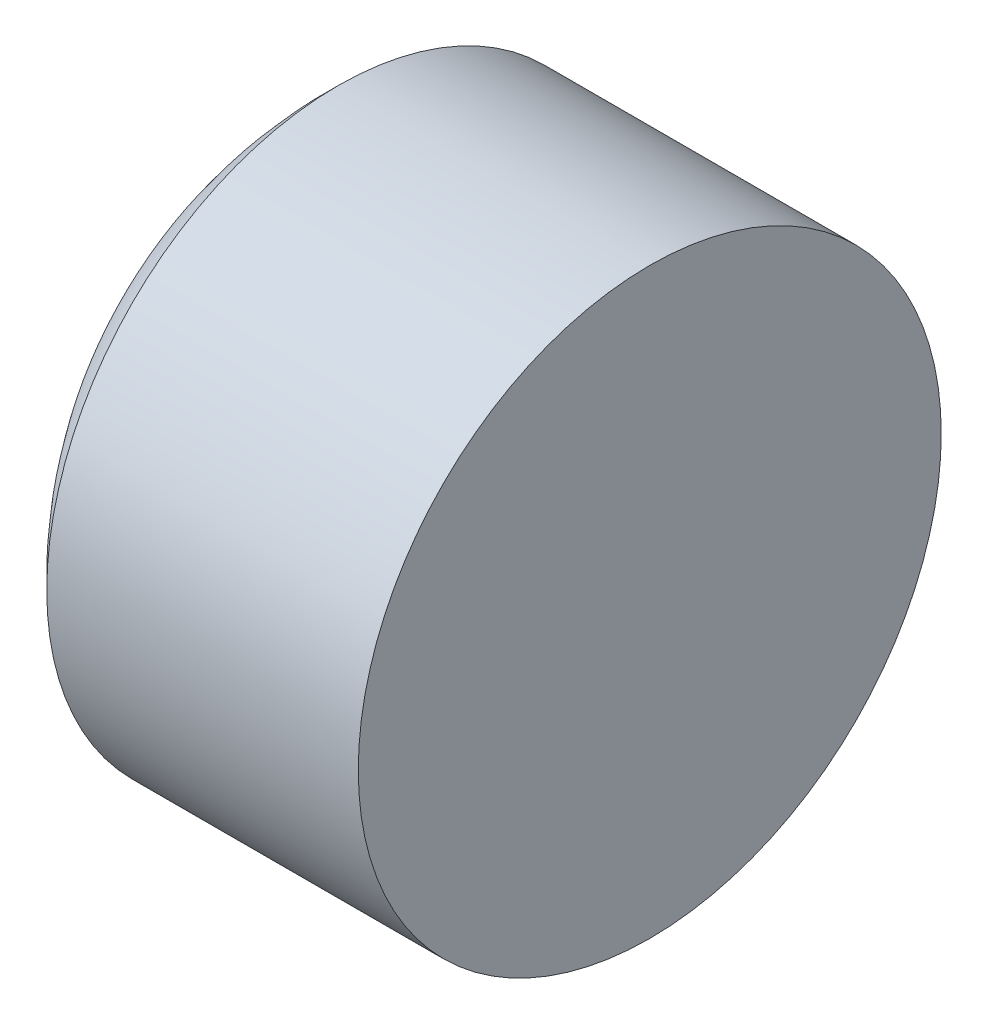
ISO-10303-21;
HEADER;
FILE_DESCRIPTION(('STEP AP214'),'2;1');
FILE_NAME('part.step','',(''),(''),'','','');
FILE_SCHEMA(('AUTOMOTIVE_DESIGN { 1 0 10303 214 1 1 1 1 }'));
ENDSEC;
DATA;
#1=APPLICATION_CONTEXT('core data for automotive mechanical design processes');
#2=APPLICATION_PROTOCOL_DEFINITION('international standard','automotive_design',2000,#1);
#3=PRODUCT_CONTEXT('',#1,'mechanical');
#4=PRODUCT('Part','Part','',(#3));
#5=PRODUCT_RELATED_PRODUCT_CATEGORY('part','',(#4));
#6=PRODUCT_DEFINITION_FORMATION('','',#4);
#7=PRODUCT_DEFINITION_CONTEXT('part definition',#1,'design');
#8=PRODUCT_DEFINITION('design','',#6,#7);
#9=PRODUCT_DEFINITION_SHAPE('','',#8);
#10=(LENGTH_UNIT() NAMED_UNIT(*) SI_UNIT(.MILLI.,.METRE.));
#11=(NAMED_UNIT(*) PLANE_ANGLE_UNIT() SI_UNIT($,.RADIAN.));
#12=(NAMED_UNIT(*) SI_UNIT($,.STERADIAN.) SOLID_ANGLE_UNIT());
#13=UNCERTAINTY_MEASURE_WITH_UNIT(LENGTH_MEASURE(1.E-05),#10,'distance_accuracy_value','');
#14=(GEOMETRIC_REPRESENTATION_CONTEXT(3) GLOBAL_UNCERTAINTY_ASSIGNED_CONTEXT((#13)) GLOBAL_UNIT_ASSIGNED_CONTEXT((#10,
#11,#12)) REPRESENTATION_CONTEXT('',''));
#15=CARTESIAN_POINT('',(0.,0.,0.));
#16=DIRECTION('',(0.,0.,1.));
#17=DIRECTION('',(1.,0.,0.));
#18=AXIS2_PLACEMENT_3D('',#15,#16,#17);
#19=CARTESIAN_POINT('',(0.,0.,0.));
#20=DIRECTION('',(-1.,0.,0.));
#21=DIRECTION('',(0.,1.,0.));
#22=AXIS2_PLACEMENT_3D('',#19,#20,#21);
#23=SPHERICAL_SURFACE('',#22,139.7);
#24=CARTESIAN_POINT('',(-95.8828973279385,0.,0.));
#25=DIRECTION('',(-1.,0.,0.));
#26=DIRECTION('',(0.,0.,1.));
#27=AXIS2_PLACEMENT_3D('',#24,#25,#26);
#28=CIRCLE('',#27,101.6);
#29=CARTESIAN_POINT('',(-95.8828973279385,0.,101.6));
#30=VERTEX_POINT('',#29);
#31=EDGE_CURVE('E42',#30,#30,#28,.T.);
#32=ORIENTED_EDGE('',*,*,#31,.T.);
#33=EDGE_LOOP('',(#32));
#34=FACE_BOUND('',#33,.T.);
#35=ADVANCED_FACE('F35',(#34),#23,.T.);
#36=CARTESIAN_POINT('',(12.7,0.,0.));
#37=DIRECTION('',(-1.,0.,0.));
#38=DIRECTION('',(0.,0.,1.));
#39=AXIS2_PLACEMENT_3D('',#36,#37,#38);
#40=PLANE('',#39);
#41=CARTESIAN_POINT('',(12.7,0.,0.));
#42=DIRECTION('',(-1.,0.,0.));
#43=DIRECTION('',(0.,0.,1.));
#44=AXIS2_PLACEMENT_3D('',#41,#42,#43);
#45=CIRCLE('',#44,101.6);
#46=CARTESIAN_POINT('',(12.7,0.,101.6));
#47=VERTEX_POINT('',#46);
#48=EDGE_CURVE('E10',#47,#47,#45,.T.);
#49=ORIENTED_EDGE('',*,*,#48,.F.);
#50=EDGE_LOOP('',(#49));
#51=FACE_BOUND('',#50,.T.);
#52=ADVANCED_FACE('F51',(#51),#40,.F.);
#53=CARTESIAN_POINT('',(0.,0.,0.));
#54=DIRECTION('',(-1.,0.,0.));
#55=DIRECTION('',(0.,0.,1.));
#56=AXIS2_PLACEMENT_3D('',#53,#54,#55);
#57=CYLINDRICAL_SURFACE('',#56,101.6);
#58=ORIENTED_EDGE('',*,*,#31,.F.);
#59=EDGE_LOOP('',(#58));
#60=FACE_BOUND('',#59,.T.);
#61=ORIENTED_EDGE('',*,*,#48,.T.);
#62=EDGE_LOOP('',(#61));
#63=FACE_BOUND('',#62,.T.);
#64=ADVANCED_FACE('F49',(#60,#63),#57,.T.);
#65=CLOSED_SHELL('',(#35,#52,#64));
#66=MANIFOLD_SOLID_BREP('B2',#65);
#67=ADVANCED_BREP_SHAPE_REPRESENTATION('',(#18,#66),#14);
#68=SHAPE_DEFINITION_REPRESENTATION(#9,#67);
ENDSEC;
END-ISO-10303-21;
